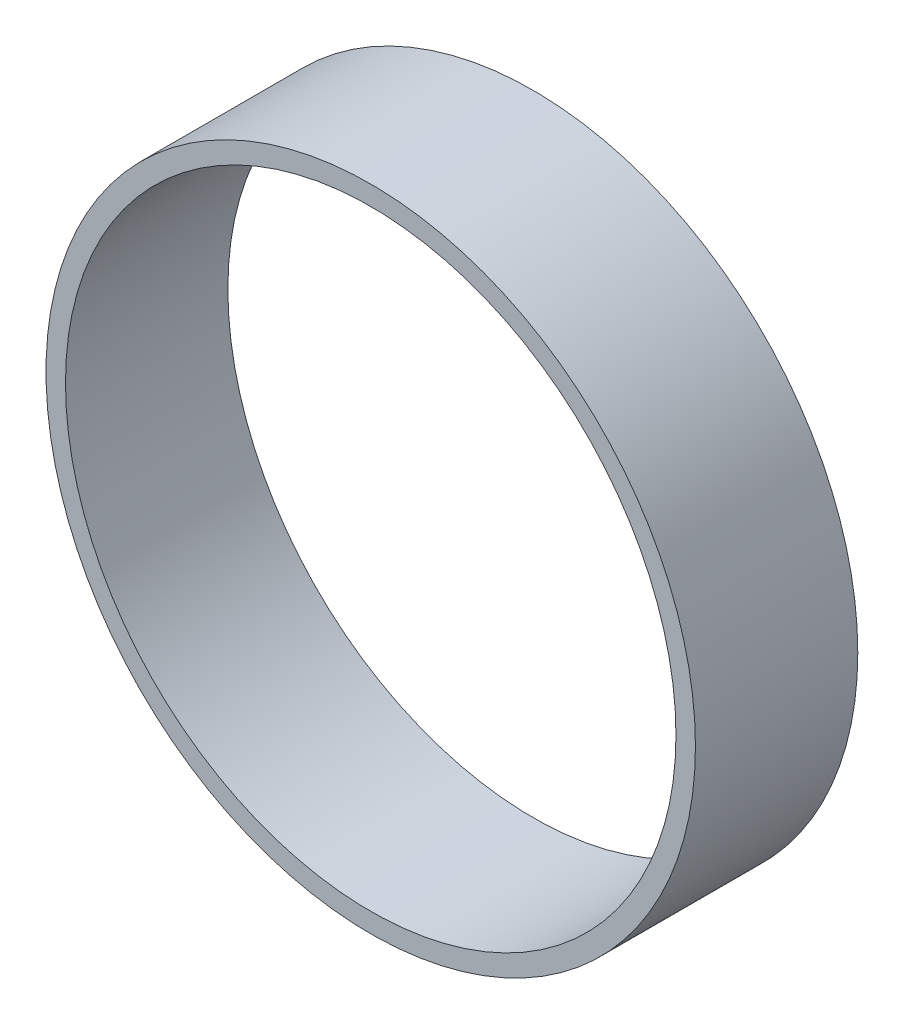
ISO-10303-21;
HEADER;
FILE_DESCRIPTION(('STEP AP214'),'2;1');
FILE_NAME('part.step','',(''),(''),'','','');
FILE_SCHEMA(('AUTOMOTIVE_DESIGN { 1 0 10303 214 1 1 1 1 }'));
ENDSEC;
DATA;
#1=APPLICATION_CONTEXT('core data for automotive mechanical design processes');
#2=APPLICATION_PROTOCOL_DEFINITION('international standard','automotive_design',2000,#1);
#3=PRODUCT_CONTEXT('',#1,'mechanical');
#4=PRODUCT('Part','Part','',(#3));
#5=PRODUCT_RELATED_PRODUCT_CATEGORY('part','',(#4));
#6=PRODUCT_DEFINITION_FORMATION('','',#4);
#7=PRODUCT_DEFINITION_CONTEXT('part definition',#1,'design');
#8=PRODUCT_DEFINITION('design','',#6,#7);
#9=PRODUCT_DEFINITION_SHAPE('','',#8);
#10=(LENGTH_UNIT() NAMED_UNIT(*) SI_UNIT(.MILLI.,.METRE.));
#11=(NAMED_UNIT(*) PLANE_ANGLE_UNIT() SI_UNIT($,.RADIAN.));
#12=(NAMED_UNIT(*) SI_UNIT($,.STERADIAN.) SOLID_ANGLE_UNIT());
#13=UNCERTAINTY_MEASURE_WITH_UNIT(LENGTH_MEASURE(1.E-05),#10,'distance_accuracy_value','');
#14=(GEOMETRIC_REPRESENTATION_CONTEXT(3) GLOBAL_UNCERTAINTY_ASSIGNED_CONTEXT((#13)) GLOBAL_UNIT_ASSIGNED_CONTEXT((#10,
#11,#12)) REPRESENTATION_CONTEXT('',''));
#15=CARTESIAN_POINT('',(0.,0.,0.));
#16=DIRECTION('',(0.,0.,1.));
#17=DIRECTION('',(1.,0.,0.));
#18=AXIS2_PLACEMENT_3D('',#15,#16,#17);
#19=CARTESIAN_POINT('',(0.,0.,25.));
#20=DIRECTION('',(0.,0.,1.));
#21=DIRECTION('',(1.,0.,0.));
#22=AXIS2_PLACEMENT_3D('',#19,#20,#21);
#23=PLANE('',#22);
#24=CARTESIAN_POINT('',(0.,0.,25.));
#25=DIRECTION('',(0.,0.,1.));
#26=DIRECTION('',(1.,0.,0.));
#27=AXIS2_PLACEMENT_3D('',#24,#25,#26);
#28=CIRCLE('',#27,50.);
#29=CARTESIAN_POINT('',(50.,0.,25.));
#30=VERTEX_POINT('',#29);
#31=EDGE_CURVE('E10',#30,#30,#28,.T.);
#32=ORIENTED_EDGE('',*,*,#31,.T.);
#33=EDGE_LOOP('',(#32));
#34=FACE_BOUND('',#33,.T.);
#35=CARTESIAN_POINT('',(0.,0.,25.));
#36=DIRECTION('',(0.,0.,1.));
#37=DIRECTION('',(1.,0.,0.));
#38=AXIS2_PLACEMENT_3D('',#35,#36,#37);
#39=CIRCLE('',#38,47.);
#40=CARTESIAN_POINT('',(47.,0.,25.));
#41=VERTEX_POINT('',#40);
#42=EDGE_CURVE('E42',#41,#41,#39,.T.);
#43=ORIENTED_EDGE('',*,*,#42,.F.);
#44=EDGE_LOOP('',(#43));
#45=FACE_BOUND('',#44,.T.);
#46=ADVANCED_FACE('F31',(#34,#45),#23,.T.);
#47=CARTESIAN_POINT('',(0.,0.,0.));
#48=DIRECTION('',(0.,0.,1.));
#49=DIRECTION('',(1.,0.,0.));
#50=AXIS2_PLACEMENT_3D('',#47,#48,#49);
#51=PLANE('',#50);
#52=CARTESIAN_POINT('',(0.,0.,0.));
#53=DIRECTION('',(0.,0.,1.));
#54=DIRECTION('',(1.,0.,0.));
#55=AXIS2_PLACEMENT_3D('',#52,#53,#54);
#56=CIRCLE('',#55,50.);
#57=CARTESIAN_POINT('',(50.,0.,0.));
#58=VERTEX_POINT('',#57);
#59=EDGE_CURVE('E35',#58,#58,#56,.T.);
#60=ORIENTED_EDGE('',*,*,#59,.F.);
#61=EDGE_LOOP('',(#60));
#62=FACE_BOUND('',#61,.T.);
#63=CARTESIAN_POINT('',(0.,0.,0.));
#64=DIRECTION('',(0.,0.,1.));
#65=DIRECTION('',(1.,0.,0.));
#66=AXIS2_PLACEMENT_3D('',#63,#64,#65);
#67=CIRCLE('',#66,47.);
#68=CARTESIAN_POINT('',(47.,0.,0.));
#69=VERTEX_POINT('',#68);
#70=EDGE_CURVE('E44',#69,#69,#67,.T.);
#71=ORIENTED_EDGE('',*,*,#70,.T.);
#72=EDGE_LOOP('',(#71));
#73=FACE_BOUND('',#72,.T.);
#74=ADVANCED_FACE('F54',(#62,#73),#51,.F.);
#75=CARTESIAN_POINT('',(0.,0.,25.));
#76=DIRECTION('',(0.,0.,-1.));
#77=DIRECTION('',(-1.,0.,0.));
#78=AXIS2_PLACEMENT_3D('',#75,#76,#77);
#79=CYLINDRICAL_SURFACE('',#78,50.);
#80=ORIENTED_EDGE('',*,*,#31,.F.);
#81=EDGE_LOOP('',(#80));
#82=FACE_BOUND('',#81,.T.);
#83=ORIENTED_EDGE('',*,*,#59,.T.);
#84=EDGE_LOOP('',(#83));
#85=FACE_BOUND('',#84,.T.);
#86=ADVANCED_FACE('F33',(#82,#85),#79,.T.);
#87=CARTESIAN_POINT('',(0.,0.,25.));
#88=DIRECTION('',(0.,0.,-1.));
#89=DIRECTION('',(-1.,0.,0.));
#90=AXIS2_PLACEMENT_3D('',#87,#88,#89);
#91=CYLINDRICAL_SURFACE('',#90,47.);
#92=ORIENTED_EDGE('',*,*,#42,.T.);
#93=EDGE_LOOP('',(#92));
#94=FACE_BOUND('',#93,.T.);
#95=ORIENTED_EDGE('',*,*,#70,.F.);
#96=EDGE_LOOP('',(#95));
#97=FACE_BOUND('',#96,.T.);
#98=ADVANCED_FACE('F50',(#94,#97),#91,.F.);
#99=CLOSED_SHELL('',(#46,#74,#86,#98));
#100=MANIFOLD_SOLID_BREP('B2',#99);
#101=ADVANCED_BREP_SHAPE_REPRESENTATION('',(#18,#100),#14);
#102=SHAPE_DEFINITION_REPRESENTATION(#9,#101);
ENDSEC;
END-ISO-10303-21;
